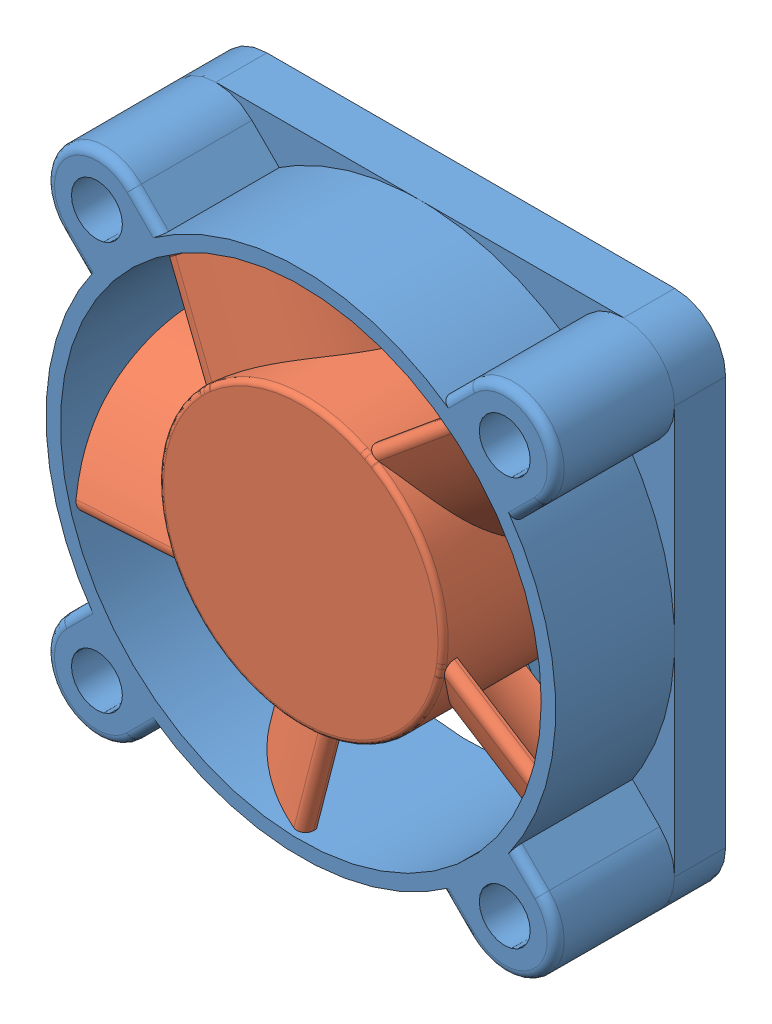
SolidWorks assembly Fan Assem.SLDASM, configuration Default (file format 17000). Lengths in mm.
Overall size (39.4 39.4 10.26).
2 component instances, 2 part files, 2 mates.
Components (placement in the parent):
- Fan Mount-1: Fan Mount.SLDPRT [Default] at (12.866 15.0226 17.5776) size (30 30 10.03)
- Fan Blades-1: Fan Blades.SLDPRT [Default] at (12.866 15.0226 23.5776) x (0.770588 0.637333 0) z (0 0 1) size (27.97 28 8.82)
Mates (geometry in assembly coordinates):
- Concentric1: concentric: cylinder of Fan Mount-1 through (12.866 15.0226 19.0776) axis (0 0 -1) radius 0.75; cylinder of Fan Blades-1 through (12.866 15.0226 26.5776) axis (0 0 -1) radius 0.75
- Distance1: distance = 0.5 mm: plane of Fan Blades-1 through (12.866 15.0226 19.5776) normal (0 0 -1); plane of Fan Mount-1 through (12.866 15.0226 19.0776) normal (0 0 1)
